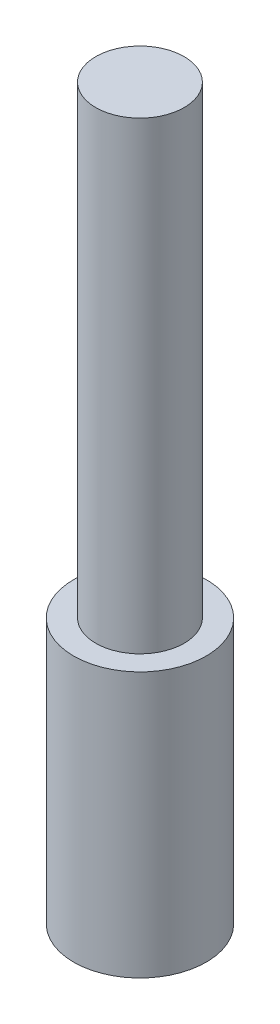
ISO-10303-21;
HEADER;
FILE_DESCRIPTION(('STEP AP214'),'2;1');
FILE_NAME('part.step','',(''),(''),'','','');
FILE_SCHEMA(('AUTOMOTIVE_DESIGN { 1 0 10303 214 1 1 1 1 }'));
ENDSEC;
DATA;
#1=APPLICATION_CONTEXT('core data for automotive mechanical design processes');
#2=APPLICATION_PROTOCOL_DEFINITION('international standard','automotive_design',2000,#1);
#3=PRODUCT_CONTEXT('',#1,'mechanical');
#4=PRODUCT('Part','Part','',(#3));
#5=PRODUCT_RELATED_PRODUCT_CATEGORY('part','',(#4));
#6=PRODUCT_DEFINITION_FORMATION('','',#4);
#7=PRODUCT_DEFINITION_CONTEXT('part definition',#1,'design');
#8=PRODUCT_DEFINITION('design','',#6,#7);
#9=PRODUCT_DEFINITION_SHAPE('','',#8);
#10=(LENGTH_UNIT() NAMED_UNIT(*) SI_UNIT(.MILLI.,.METRE.));
#11=(NAMED_UNIT(*) PLANE_ANGLE_UNIT() SI_UNIT($,.RADIAN.));
#12=(NAMED_UNIT(*) SI_UNIT($,.STERADIAN.) SOLID_ANGLE_UNIT());
#13=UNCERTAINTY_MEASURE_WITH_UNIT(LENGTH_MEASURE(1.E-05),#10,'distance_accuracy_value','');
#14=(GEOMETRIC_REPRESENTATION_CONTEXT(3) GLOBAL_UNCERTAINTY_ASSIGNED_CONTEXT((#13)) GLOBAL_UNIT_ASSIGNED_CONTEXT((#10,
#11,#12)) REPRESENTATION_CONTEXT('',''));
#15=CARTESIAN_POINT('',(0.,0.,0.));
#16=DIRECTION('',(0.,0.,1.));
#17=DIRECTION('',(1.,0.,0.));
#18=AXIS2_PLACEMENT_3D('',#15,#16,#17);
#19=CARTESIAN_POINT('',(1.5,6.,0.));
#20=DIRECTION('',(0.,1.,0.));
#21=DIRECTION('',(0.,0.,1.));
#22=AXIS2_PLACEMENT_3D('',#19,#20,#21);
#23=PLANE('',#22);
#24=CARTESIAN_POINT('',(1.5,6.,0.));
#25=DIRECTION('',(0.,1.,0.));
#26=DIRECTION('',(0.,0.,1.));
#27=AXIS2_PLACEMENT_3D('',#24,#25,#26);
#28=CIRCLE('',#27,1.);
#29=CARTESIAN_POINT('',(0.633974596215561,6.,0.5));
#30=VERTEX_POINT('',#29);
#31=CARTESIAN_POINT('',(0.633974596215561,6.,-0.5));
#32=VERTEX_POINT('',#31);
#33=EDGE_CURVE('E144',#30,#32,#28,.T.);
#34=ORIENTED_EDGE('',*,*,#33,.F.);
#35=DIRECTION('',(-1.,0.,0.));
#36=VECTOR('',#35,1.);
#37=CARTESIAN_POINT('',(1.5,6.,0.5));
#38=LINE('',#37,#36);
#39=CARTESIAN_POINT('',(1.5,6.,0.5));
#40=VERTEX_POINT('',#39);
#41=EDGE_CURVE('E142',#40,#30,#38,.T.);
#42=ORIENTED_EDGE('',*,*,#41,.F.);
#43=DIRECTION('',(0.,0.,1.));
#44=VECTOR('',#43,1.);
#45=CARTESIAN_POINT('',(1.5,6.,-0.5));
#46=LINE('',#45,#44);
#47=CARTESIAN_POINT('',(1.5,6.,-0.5));
#48=VERTEX_POINT('',#47);
#49=EDGE_CURVE('E139',#48,#40,#46,.T.);
#50=ORIENTED_EDGE('',*,*,#49,.F.);
#51=DIRECTION('',(-1.,0.,0.));
#52=VECTOR('',#51,1.);
#53=CARTESIAN_POINT('',(1.5,6.,-0.5));
#54=LINE('',#53,#52);
#55=EDGE_CURVE('E145',#48,#32,#54,.T.);
#56=ORIENTED_EDGE('',*,*,#55,.T.);
#57=EDGE_LOOP('',(#34,#42,#50,#56));
#58=FACE_BOUND('',#57,.T.);
#59=CARTESIAN_POINT('',(1.5,6.,0.));
#60=DIRECTION('',(0.,1.,0.));
#61=DIRECTION('',(0.,0.,1.));
#62=AXIS2_PLACEMENT_3D('',#59,#60,#61);
#63=CIRCLE('',#62,1.5);
#64=CARTESIAN_POINT('',(1.5,6.,1.5));
#65=VERTEX_POINT('',#64);
#66=EDGE_CURVE('E158',#65,#65,#63,.T.);
#67=ORIENTED_EDGE('',*,*,#66,.T.);
#68=EDGE_LOOP('',(#67));
#69=FACE_BOUND('',#68,.T.);
#70=ADVANCED_FACE('F35',(#58,#69),#23,.T.);
#71=CARTESIAN_POINT('',(1.5,6.,0.));
#72=DIRECTION('',(0.,-1.,0.));
#73=DIRECTION('',(0.,0.,-1.));
#74=AXIS2_PLACEMENT_3D('',#71,#72,#73);
#75=CYLINDRICAL_SURFACE('',#74,1.5);
#76=ORIENTED_EDGE('',*,*,#66,.F.);
#77=EDGE_LOOP('',(#76));
#78=FACE_BOUND('',#77,.T.);
#79=CARTESIAN_POINT('',(1.5,0.,0.));
#80=DIRECTION('',(0.,1.,0.));
#81=DIRECTION('',(0.,0.,1.));
#82=AXIS2_PLACEMENT_3D('',#79,#80,#81);
#83=CIRCLE('',#82,1.5);
#84=CARTESIAN_POINT('',(1.5,0.,1.5));
#85=VERTEX_POINT('',#84);
#86=EDGE_CURVE('E155',#85,#85,#83,.T.);
#87=ORIENTED_EDGE('',*,*,#86,.T.);
#88=EDGE_LOOP('',(#87));
#89=FACE_BOUND('',#88,.T.);
#90=ADVANCED_FACE('F37',(#78,#89),#75,.T.);
#91=CARTESIAN_POINT('',(1.5,0.,0.));
#92=DIRECTION('',(0.,1.,0.));
#93=DIRECTION('',(0.,0.,1.));
#94=AXIS2_PLACEMENT_3D('',#91,#92,#93);
#95=PLANE('',#94);
#96=ORIENTED_EDGE('',*,*,#86,.F.);
#97=EDGE_LOOP('',(#96));
#98=FACE_BOUND('',#97,.T.);
#99=ADVANCED_FACE('F199',(#98),#95,.F.);
#100=CARTESIAN_POINT('',(1.5,16.5,0.));
#101=DIRECTION('',(0.,-1.,0.));
#102=DIRECTION('',(0.,0.,-1.));
#103=AXIS2_PLACEMENT_3D('',#100,#101,#102);
#104=CYLINDRICAL_SURFACE('',#103,1.);
#105=DIRECTION('',(0.,-1.,0.));
#106=VECTOR('',#105,1.);
#107=CARTESIAN_POINT('',(0.633974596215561,16.5,-0.5));
#108=LINE('',#107,#106);
#109=CARTESIAN_POINT('',(0.633974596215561,12.,-0.5));
#110=VERTEX_POINT('',#109);
#111=CARTESIAN_POINT('',(0.633974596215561,13.5,-0.5));
#112=VERTEX_POINT('',#111);
#113=EDGE_CURVE('E11',#110,#112,#108,.F.);
#114=ORIENTED_EDGE('',*,*,#113,.T.);
#115=CARTESIAN_POINT('',(1.5,13.5,0.));
#116=DIRECTION('',(0.,1.,0.));
#117=DIRECTION('',(0.,0.,1.));
#118=AXIS2_PLACEMENT_3D('',#115,#116,#117);
#119=CIRCLE('',#118,1.);
#120=CARTESIAN_POINT('',(0.633974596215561,13.5,0.5));
#121=VERTEX_POINT('',#120);
#122=EDGE_CURVE('E172',#112,#121,#119,.T.);
#123=ORIENTED_EDGE('',*,*,#122,.T.);
#124=DIRECTION('',(0.,-1.,0.));
#125=VECTOR('',#124,1.);
#126=CARTESIAN_POINT('',(0.633974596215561,16.5,0.5));
#127=LINE('',#126,#125);
#128=CARTESIAN_POINT('',(0.633974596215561,12.,0.5));
#129=VERTEX_POINT('',#128);
#130=EDGE_CURVE('E43',#121,#129,#127,.T.);
#131=ORIENTED_EDGE('',*,*,#130,.T.);
#132=CARTESIAN_POINT('',(1.5,12.,0.));
#133=DIRECTION('',(0.,-1.,0.));
#134=DIRECTION('',(0.,0.,-1.));
#135=AXIS2_PLACEMENT_3D('',#132,#133,#134);
#136=CIRCLE('',#135,1.);
#137=EDGE_CURVE('E174',#129,#110,#136,.T.);
#138=ORIENTED_EDGE('',*,*,#137,.T.);
#139=EDGE_LOOP('',(#114,#123,#131,#138));
#140=FACE_BOUND('',#139,.T.);
#141=CARTESIAN_POINT('',(1.5,16.5,0.));
#142=DIRECTION('',(0.,1.,0.));
#143=DIRECTION('',(0.,0.,1.));
#144=AXIS2_PLACEMENT_3D('',#141,#142,#143);
#145=CIRCLE('',#144,1.);
#146=CARTESIAN_POINT('',(1.5,16.5,1.));
#147=VERTEX_POINT('',#146);
#148=EDGE_CURVE('E152',#147,#147,#145,.T.);
#149=ORIENTED_EDGE('',*,*,#148,.F.);
#150=EDGE_LOOP('',(#149));
#151=FACE_BOUND('',#150,.T.);
#152=ORIENTED_EDGE('',*,*,#33,.T.);
#153=DIRECTION('',(0.,-1.,0.));
#154=VECTOR('',#153,1.);
#155=CARTESIAN_POINT('',(0.633974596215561,16.5,-0.5));
#156=LINE('',#155,#154);
#157=CARTESIAN_POINT('',(0.633974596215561,7.5,-0.5));
#158=VERTEX_POINT('',#157);
#159=EDGE_CURVE('E169',#32,#158,#156,.F.);
#160=ORIENTED_EDGE('',*,*,#159,.T.);
#161=CARTESIAN_POINT('',(1.5,7.5,0.));
#162=DIRECTION('',(0.,1.,0.));
#163=DIRECTION('',(0.,0.,1.));
#164=AXIS2_PLACEMENT_3D('',#161,#162,#163);
#165=CIRCLE('',#164,1.);
#166=CARTESIAN_POINT('',(0.633974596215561,7.5,0.5));
#167=VERTEX_POINT('',#166);
#168=EDGE_CURVE('E161',#158,#167,#165,.T.);
#169=ORIENTED_EDGE('',*,*,#168,.T.);
#170=DIRECTION('',(0.,-1.,0.));
#171=VECTOR('',#170,1.);
#172=CARTESIAN_POINT('',(0.633974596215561,16.5,0.5));
#173=LINE('',#172,#171);
#174=EDGE_CURVE('E166',#167,#30,#173,.T.);
#175=ORIENTED_EDGE('',*,*,#174,.T.);
#176=EDGE_LOOP('',(#152,#160,#169,#175));
#177=FACE_BOUND('',#176,.T.);
#178=ADVANCED_FACE('F177',(#140,#151,#177),#104,.T.);
#179=CARTESIAN_POINT('',(1.5,16.5,0.));
#180=DIRECTION('',(0.,1.,0.));
#181=DIRECTION('',(0.,0.,1.));
#182=AXIS2_PLACEMENT_3D('',#179,#180,#181);
#183=PLANE('',#182);
#184=ORIENTED_EDGE('',*,*,#148,.T.);
#185=EDGE_LOOP('',(#184));
#186=FACE_BOUND('',#185,.T.);
#187=ADVANCED_FACE('F210',(#186),#183,.T.);
#188=CARTESIAN_POINT('',(1.5,6.,0.5));
#189=DIRECTION('',(0.,0.,1.));
#190=DIRECTION('',(1.,0.,0.));
#191=AXIS2_PLACEMENT_3D('',#188,#189,#190);
#192=PLANE('',#191);
#193=DIRECTION('',(-1.,0.,0.));
#194=VECTOR('',#193,1.);
#195=CARTESIAN_POINT('',(1.5,7.5,0.5));
#196=LINE('',#195,#194);
#197=CARTESIAN_POINT('',(1.5,7.5,0.5));
#198=VERTEX_POINT('',#197);
#199=EDGE_CURVE('E58',#198,#167,#196,.T.);
#200=ORIENTED_EDGE('',*,*,#199,.F.);
#201=DIRECTION('',(0.,1.,0.));
#202=VECTOR('',#201,1.);
#203=CARTESIAN_POINT('',(1.5,6.,0.5));
#204=LINE('',#203,#202);
#205=EDGE_CURVE('E126',#40,#198,#204,.T.);
#206=ORIENTED_EDGE('',*,*,#205,.F.);
#207=ORIENTED_EDGE('',*,*,#41,.T.);
#208=ORIENTED_EDGE('',*,*,#174,.F.);
#209=EDGE_LOOP('',(#200,#206,#207,#208));
#210=FACE_BOUND('',#209,.T.);
#211=ADVANCED_FACE('F216',(#210),#192,.F.);
#212=CARTESIAN_POINT('',(1.5,6.,-0.5));
#213=DIRECTION('',(0.,0.,-1.));
#214=DIRECTION('',(-1.,0.,0.));
#215=AXIS2_PLACEMENT_3D('',#212,#213,#214);
#216=PLANE('',#215);
#217=ORIENTED_EDGE('',*,*,#55,.F.);
#218=DIRECTION('',(0.,-1.,0.));
#219=VECTOR('',#218,1.);
#220=CARTESIAN_POINT('',(1.5,6.,-0.5));
#221=LINE('',#220,#219);
#222=CARTESIAN_POINT('',(1.5,7.5,-0.5));
#223=VERTEX_POINT('',#222);
#224=EDGE_CURVE('E136',#223,#48,#221,.T.);
#225=ORIENTED_EDGE('',*,*,#224,.F.);
#226=DIRECTION('',(-1.,0.,0.));
#227=VECTOR('',#226,1.);
#228=CARTESIAN_POINT('',(1.5,7.5,-0.5));
#229=LINE('',#228,#227);
#230=EDGE_CURVE('E148',#223,#158,#229,.T.);
#231=ORIENTED_EDGE('',*,*,#230,.T.);
#232=ORIENTED_EDGE('',*,*,#159,.F.);
#233=EDGE_LOOP('',(#217,#225,#231,#232));
#234=FACE_BOUND('',#233,.T.);
#235=ADVANCED_FACE('F221',(#234),#216,.F.);
#236=CARTESIAN_POINT('',(1.5,7.5,-0.5));
#237=DIRECTION('',(0.,1.,0.));
#238=DIRECTION('',(0.,0.,1.));
#239=AXIS2_PLACEMENT_3D('',#236,#237,#238);
#240=PLANE('',#239);
#241=ORIENTED_EDGE('',*,*,#230,.F.);
#242=DIRECTION('',(0.,0.,-1.));
#243=VECTOR('',#242,1.);
#244=CARTESIAN_POINT('',(1.5,7.5,-0.5));
#245=LINE('',#244,#243);
#246=EDGE_CURVE('E133',#198,#223,#245,.T.);
#247=ORIENTED_EDGE('',*,*,#246,.F.);
#248=ORIENTED_EDGE('',*,*,#199,.T.);
#249=ORIENTED_EDGE('',*,*,#168,.F.);
#250=EDGE_LOOP('',(#241,#247,#248,#249));
#251=FACE_BOUND('',#250,.T.);
#252=ADVANCED_FACE('F225',(#251),#240,.F.);
#253=CARTESIAN_POINT('',(1.5,0.,0.));
#254=DIRECTION('',(1.,0.,0.));
#255=DIRECTION('',(0.,0.,-1.));
#256=AXIS2_PLACEMENT_3D('',#253,#254,#255);
#257=PLANE('',#256);
#258=ORIENTED_EDGE('',*,*,#205,.T.);
#259=ORIENTED_EDGE('',*,*,#246,.T.);
#260=ORIENTED_EDGE('',*,*,#224,.T.);
#261=ORIENTED_EDGE('',*,*,#49,.T.);
#262=EDGE_LOOP('',(#258,#259,#260,#261));
#263=FACE_BOUND('',#262,.T.);
#264=ADVANCED_FACE('F190',(#263),#257,.F.);
#265=CARTESIAN_POINT('',(1.5,12.,0.5));
#266=DIRECTION('',(0.,0.,1.));
#267=DIRECTION('',(1.,0.,0.));
#268=AXIS2_PLACEMENT_3D('',#265,#266,#267);
#269=PLANE('',#268);
#270=DIRECTION('',(-1.,0.,0.));
#271=VECTOR('',#270,1.);
#272=CARTESIAN_POINT('',(1.5,13.5,0.5));
#273=LINE('',#272,#271);
#274=CARTESIAN_POINT('',(1.5,13.5,0.5));
#275=VERTEX_POINT('',#274);
#276=EDGE_CURVE('E50',#275,#121,#273,.T.);
#277=ORIENTED_EDGE('',*,*,#276,.F.);
#278=DIRECTION('',(0.,1.,0.));
#279=VECTOR('',#278,1.);
#280=CARTESIAN_POINT('',(1.5,12.,0.5));
#281=LINE('',#280,#279);
#282=CARTESIAN_POINT('',(1.5,12.,0.5));
#283=VERTEX_POINT('',#282);
#284=EDGE_CURVE('E102',#283,#275,#281,.T.);
#285=ORIENTED_EDGE('',*,*,#284,.F.);
#286=DIRECTION('',(-1.,0.,0.));
#287=VECTOR('',#286,1.);
#288=CARTESIAN_POINT('',(1.5,12.,0.5));
#289=LINE('',#288,#287);
#290=EDGE_CURVE('E124',#283,#129,#289,.T.);
#291=ORIENTED_EDGE('',*,*,#290,.T.);
#292=ORIENTED_EDGE('',*,*,#130,.F.);
#293=EDGE_LOOP('',(#277,#285,#291,#292));
#294=FACE_BOUND('',#293,.T.);
#295=ADVANCED_FACE('F99',(#294),#269,.F.);
#296=CARTESIAN_POINT('',(1.5,12.,-0.5));
#297=DIRECTION('',(0.,-1.,0.));
#298=DIRECTION('',(0.,0.,-1.));
#299=AXIS2_PLACEMENT_3D('',#296,#297,#298);
#300=PLANE('',#299);
#301=ORIENTED_EDGE('',*,*,#290,.F.);
#302=DIRECTION('',(0.,0.,1.));
#303=VECTOR('',#302,1.);
#304=CARTESIAN_POINT('',(1.5,12.,-0.5));
#305=LINE('',#304,#303);
#306=CARTESIAN_POINT('',(1.5,12.,-0.5));
#307=VERTEX_POINT('',#306);
#308=EDGE_CURVE('E107',#307,#283,#305,.T.);
#309=ORIENTED_EDGE('',*,*,#308,.F.);
#310=DIRECTION('',(-1.,0.,0.));
#311=VECTOR('',#310,1.);
#312=CARTESIAN_POINT('',(1.5,12.,-0.5));
#313=LINE('',#312,#311);
#314=EDGE_CURVE('E127',#307,#110,#313,.T.);
#315=ORIENTED_EDGE('',*,*,#314,.T.);
#316=ORIENTED_EDGE('',*,*,#137,.F.);
#317=EDGE_LOOP('',(#301,#309,#315,#316));
#318=FACE_BOUND('',#317,.T.);
#319=ADVANCED_FACE('F182',(#318),#300,.F.);
#320=CARTESIAN_POINT('',(1.5,12.,-0.5));
#321=DIRECTION('',(0.,0.,-1.));
#322=DIRECTION('',(-1.,0.,0.));
#323=AXIS2_PLACEMENT_3D('',#320,#321,#322);
#324=PLANE('',#323);
#325=ORIENTED_EDGE('',*,*,#314,.F.);
#326=DIRECTION('',(0.,-1.,0.));
#327=VECTOR('',#326,1.);
#328=CARTESIAN_POINT('',(1.5,12.,-0.5));
#329=LINE('',#328,#327);
#330=CARTESIAN_POINT('',(1.5,13.5,-0.5));
#331=VERTEX_POINT('',#330);
#332=EDGE_CURVE('E116',#331,#307,#329,.T.);
#333=ORIENTED_EDGE('',*,*,#332,.F.);
#334=DIRECTION('',(-1.,0.,0.));
#335=VECTOR('',#334,1.);
#336=CARTESIAN_POINT('',(1.5,13.5,-0.5));
#337=LINE('',#336,#335);
#338=EDGE_CURVE('E106',#331,#112,#337,.T.);
#339=ORIENTED_EDGE('',*,*,#338,.T.);
#340=ORIENTED_EDGE('',*,*,#113,.F.);
#341=EDGE_LOOP('',(#325,#333,#339,#340));
#342=FACE_BOUND('',#341,.T.);
#343=ADVANCED_FACE('F180',(#342),#324,.F.);
#344=CARTESIAN_POINT('',(1.5,13.5,-0.5));
#345=DIRECTION('',(0.,1.,0.));
#346=DIRECTION('',(0.,0.,1.));
#347=AXIS2_PLACEMENT_3D('',#344,#345,#346);
#348=PLANE('',#347);
#349=ORIENTED_EDGE('',*,*,#338,.F.);
#350=DIRECTION('',(0.,0.,-1.));
#351=VECTOR('',#350,1.);
#352=CARTESIAN_POINT('',(1.5,13.5,-0.5));
#353=LINE('',#352,#351);
#354=EDGE_CURVE('E110',#275,#331,#353,.T.);
#355=ORIENTED_EDGE('',*,*,#354,.F.);
#356=ORIENTED_EDGE('',*,*,#276,.T.);
#357=ORIENTED_EDGE('',*,*,#122,.F.);
#358=EDGE_LOOP('',(#349,#355,#356,#357));
#359=FACE_BOUND('',#358,.T.);
#360=ADVANCED_FACE('F111',(#359),#348,.F.);
#361=CARTESIAN_POINT('',(1.5,0.,0.));
#362=DIRECTION('',(1.,0.,0.));
#363=DIRECTION('',(0.,0.,-1.));
#364=AXIS2_PLACEMENT_3D('',#361,#362,#363);
#365=PLANE('',#364);
#366=ORIENTED_EDGE('',*,*,#284,.T.);
#367=ORIENTED_EDGE('',*,*,#354,.T.);
#368=ORIENTED_EDGE('',*,*,#332,.T.);
#369=ORIENTED_EDGE('',*,*,#308,.T.);
#370=EDGE_LOOP('',(#366,#367,#368,#369));
#371=FACE_BOUND('',#370,.T.);
#372=ADVANCED_FACE('F118',(#371),#365,.F.);
#373=CLOSED_SHELL('',(#70,#90,#99,#178,#187,#211,#235,#252,#264,#295,#319,#343,#360,#372));
#374=MANIFOLD_SOLID_BREP('B2',#373);
#375=ADVANCED_BREP_SHAPE_REPRESENTATION('',(#18,#374),#14);
#376=SHAPE_DEFINITION_REPRESENTATION(#9,#375);
ENDSEC;
END-ISO-10303-21;
